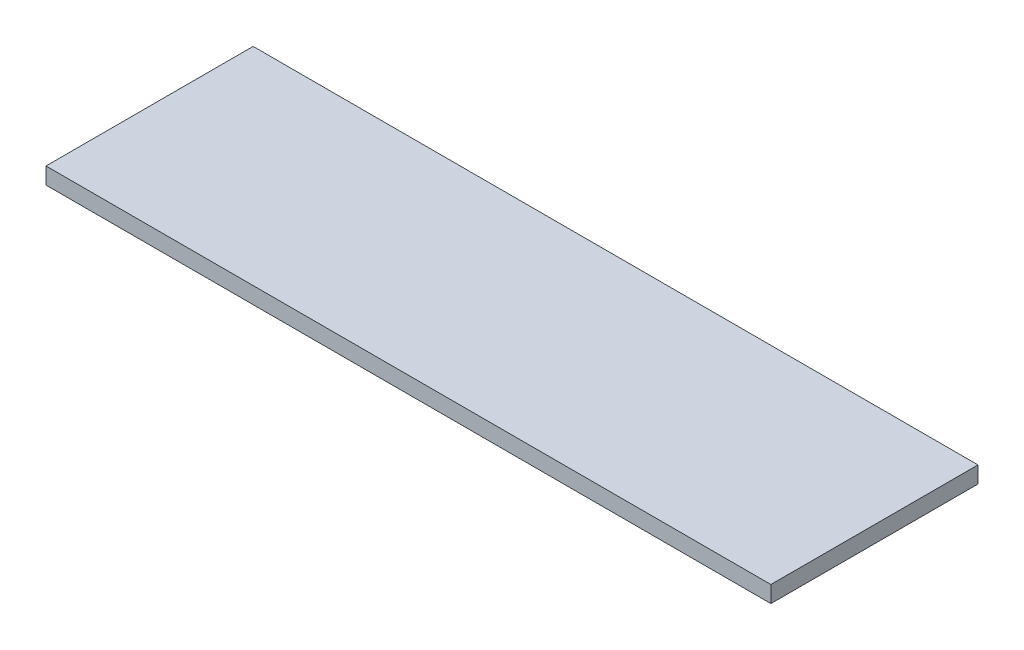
ISO-10303-21;
HEADER;
FILE_DESCRIPTION(('STEP AP214'),'2;1');
FILE_NAME('part.step','',(''),(''),'','','');
FILE_SCHEMA(('AUTOMOTIVE_DESIGN { 1 0 10303 214 1 1 1 1 }'));
ENDSEC;
DATA;
#1=APPLICATION_CONTEXT('core data for automotive mechanical design processes');
#2=APPLICATION_PROTOCOL_DEFINITION('international standard','automotive_design',2000,#1);
#3=PRODUCT_CONTEXT('',#1,'mechanical');
#4=PRODUCT('Part','Part','',(#3));
#5=PRODUCT_RELATED_PRODUCT_CATEGORY('part','',(#4));
#6=PRODUCT_DEFINITION_FORMATION('','',#4);
#7=PRODUCT_DEFINITION_CONTEXT('part definition',#1,'design');
#8=PRODUCT_DEFINITION('design','',#6,#7);
#9=PRODUCT_DEFINITION_SHAPE('','',#8);
#10=(LENGTH_UNIT() NAMED_UNIT(*) SI_UNIT(.MILLI.,.METRE.));
#11=(NAMED_UNIT(*) PLANE_ANGLE_UNIT() SI_UNIT($,.RADIAN.));
#12=(NAMED_UNIT(*) SI_UNIT($,.STERADIAN.) SOLID_ANGLE_UNIT());
#13=UNCERTAINTY_MEASURE_WITH_UNIT(LENGTH_MEASURE(1.E-05),#10,'distance_accuracy_value','');
#14=(GEOMETRIC_REPRESENTATION_CONTEXT(3) GLOBAL_UNCERTAINTY_ASSIGNED_CONTEXT((#13)) GLOBAL_UNIT_ASSIGNED_CONTEXT((#10,
#11,#12)) REPRESENTATION_CONTEXT('',''));
#15=CARTESIAN_POINT('',(0.,0.,0.));
#16=DIRECTION('',(0.,0.,1.));
#17=DIRECTION('',(1.,0.,0.));
#18=AXIS2_PLACEMENT_3D('',#15,#16,#17);
#19=CARTESIAN_POINT('',(44.45,2.032,-12.7));
#20=DIRECTION('',(-1.,0.,0.));
#21=DIRECTION('',(0.,0.,1.));
#22=AXIS2_PLACEMENT_3D('',#19,#20,#21);
#23=PLANE('',#22);
#24=DIRECTION('',(0.,0.,-1.));
#25=VECTOR('',#24,1.);
#26=CARTESIAN_POINT('',(44.45,0.,-12.7));
#27=LINE('',#26,#25);
#28=CARTESIAN_POINT('',(44.45,0.,12.7));
#29=VERTEX_POINT('',#28);
#30=CARTESIAN_POINT('',(44.45,0.,-12.7));
#31=VERTEX_POINT('',#30);
#32=EDGE_CURVE('E96',#29,#31,#27,.T.);
#33=ORIENTED_EDGE('',*,*,#32,.T.);
#34=DIRECTION('',(0.,-1.,0.));
#35=VECTOR('',#34,1.);
#36=CARTESIAN_POINT('',(44.45,2.032,-12.7));
#37=LINE('',#36,#35);
#38=CARTESIAN_POINT('',(44.45,2.032,-12.7));
#39=VERTEX_POINT('',#38);
#40=EDGE_CURVE('E11',#39,#31,#37,.T.);
#41=ORIENTED_EDGE('',*,*,#40,.F.);
#42=DIRECTION('',(0.,0.,-1.));
#43=VECTOR('',#42,1.);
#44=CARTESIAN_POINT('',(44.45,2.032,-12.7));
#45=LINE('',#44,#43);
#46=CARTESIAN_POINT('',(44.45,2.032,12.7));
#47=VERTEX_POINT('',#46);
#48=EDGE_CURVE('E84',#47,#39,#45,.T.);
#49=ORIENTED_EDGE('',*,*,#48,.F.);
#50=DIRECTION('',(0.,-1.,0.));
#51=VECTOR('',#50,1.);
#52=CARTESIAN_POINT('',(44.45,2.032,12.7));
#53=LINE('',#52,#51);
#54=EDGE_CURVE('E92',#47,#29,#53,.T.);
#55=ORIENTED_EDGE('',*,*,#54,.T.);
#56=EDGE_LOOP('',(#33,#41,#49,#55));
#57=FACE_BOUND('',#56,.T.);
#58=ADVANCED_FACE('F33',(#57),#23,.F.);
#59=CARTESIAN_POINT('',(-44.45,2.032,-12.7));
#60=DIRECTION('',(0.,0.,1.));
#61=DIRECTION('',(1.,0.,0.));
#62=AXIS2_PLACEMENT_3D('',#59,#60,#61);
#63=PLANE('',#62);
#64=DIRECTION('',(-1.,0.,0.));
#65=VECTOR('',#64,1.);
#66=CARTESIAN_POINT('',(-44.45,0.,-12.7));
#67=LINE('',#66,#65);
#68=CARTESIAN_POINT('',(-44.45,0.,-12.7));
#69=VERTEX_POINT('',#68);
#70=EDGE_CURVE('E88',#31,#69,#67,.T.);
#71=ORIENTED_EDGE('',*,*,#70,.T.);
#72=DIRECTION('',(0.,-1.,0.));
#73=VECTOR('',#72,1.);
#74=CARTESIAN_POINT('',(-44.45,2.032,-12.7));
#75=LINE('',#74,#73);
#76=CARTESIAN_POINT('',(-44.45,2.032,-12.7));
#77=VERTEX_POINT('',#76);
#78=EDGE_CURVE('E41',#77,#69,#75,.T.);
#79=ORIENTED_EDGE('',*,*,#78,.F.);
#80=DIRECTION('',(-1.,0.,0.));
#81=VECTOR('',#80,1.);
#82=CARTESIAN_POINT('',(-44.45,2.032,-12.7));
#83=LINE('',#82,#81);
#84=EDGE_CURVE('E79',#39,#77,#83,.T.);
#85=ORIENTED_EDGE('',*,*,#84,.F.);
#86=ORIENTED_EDGE('',*,*,#40,.T.);
#87=EDGE_LOOP('',(#71,#79,#85,#86));
#88=FACE_BOUND('',#87,.T.);
#89=ADVANCED_FACE('F87',(#88),#63,.F.);
#90=CARTESIAN_POINT('',(-44.45,2.032,-12.7));
#91=DIRECTION('',(1.,0.,0.));
#92=DIRECTION('',(0.,0.,-1.));
#93=AXIS2_PLACEMENT_3D('',#90,#91,#92);
#94=PLANE('',#93);
#95=DIRECTION('',(0.,0.,1.));
#96=VECTOR('',#95,1.);
#97=CARTESIAN_POINT('',(-44.45,0.,-12.7));
#98=LINE('',#97,#96);
#99=CARTESIAN_POINT('',(-44.45,0.,12.7));
#100=VERTEX_POINT('',#99);
#101=EDGE_CURVE('E66',#69,#100,#98,.T.);
#102=ORIENTED_EDGE('',*,*,#101,.T.);
#103=DIRECTION('',(0.,-1.,0.));
#104=VECTOR('',#103,1.);
#105=CARTESIAN_POINT('',(-44.45,2.032,12.7));
#106=LINE('',#105,#104);
#107=CARTESIAN_POINT('',(-44.45,2.032,12.7));
#108=VERTEX_POINT('',#107);
#109=EDGE_CURVE('E89',#108,#100,#106,.T.);
#110=ORIENTED_EDGE('',*,*,#109,.F.);
#111=DIRECTION('',(0.,0.,1.));
#112=VECTOR('',#111,1.);
#113=CARTESIAN_POINT('',(-44.45,2.032,-12.7));
#114=LINE('',#113,#112);
#115=EDGE_CURVE('E82',#77,#108,#114,.T.);
#116=ORIENTED_EDGE('',*,*,#115,.F.);
#117=ORIENTED_EDGE('',*,*,#78,.T.);
#118=EDGE_LOOP('',(#102,#110,#116,#117));
#119=FACE_BOUND('',#118,.T.);
#120=ADVANCED_FACE('F90',(#119),#94,.F.);
#121=CARTESIAN_POINT('',(-44.45,2.032,12.7));
#122=DIRECTION('',(0.,0.,-1.));
#123=DIRECTION('',(-1.,0.,0.));
#124=AXIS2_PLACEMENT_3D('',#121,#122,#123);
#125=PLANE('',#124);
#126=DIRECTION('',(1.,0.,0.));
#127=VECTOR('',#126,1.);
#128=CARTESIAN_POINT('',(-44.45,0.,12.7));
#129=LINE('',#128,#127);
#130=EDGE_CURVE('E72',#100,#29,#129,.T.);
#131=ORIENTED_EDGE('',*,*,#130,.T.);
#132=ORIENTED_EDGE('',*,*,#54,.F.);
#133=DIRECTION('',(1.,0.,0.));
#134=VECTOR('',#133,1.);
#135=CARTESIAN_POINT('',(-44.45,2.032,12.7));
#136=LINE('',#135,#134);
#137=EDGE_CURVE('E49',#108,#47,#136,.T.);
#138=ORIENTED_EDGE('',*,*,#137,.F.);
#139=ORIENTED_EDGE('',*,*,#109,.T.);
#140=EDGE_LOOP('',(#131,#132,#138,#139));
#141=FACE_BOUND('',#140,.T.);
#142=ADVANCED_FACE('F103',(#141),#125,.F.);
#143=CARTESIAN_POINT('',(0.,2.032,0.));
#144=DIRECTION('',(0.,1.,0.));
#145=DIRECTION('',(0.,0.,1.));
#146=AXIS2_PLACEMENT_3D('',#143,#144,#145);
#147=PLANE('',#146);
#148=ORIENTED_EDGE('',*,*,#48,.T.);
#149=ORIENTED_EDGE('',*,*,#84,.T.);
#150=ORIENTED_EDGE('',*,*,#115,.T.);
#151=ORIENTED_EDGE('',*,*,#137,.T.);
#152=EDGE_LOOP('',(#148,#149,#150,#151));
#153=FACE_BOUND('',#152,.T.);
#154=ADVANCED_FACE('F80',(#153),#147,.T.);
#155=CARTESIAN_POINT('',(0.,0.,0.));
#156=DIRECTION('',(0.,1.,0.));
#157=DIRECTION('',(0.,0.,1.));
#158=AXIS2_PLACEMENT_3D('',#155,#156,#157);
#159=PLANE('',#158);
#160=ORIENTED_EDGE('',*,*,#32,.F.);
#161=ORIENTED_EDGE('',*,*,#130,.F.);
#162=ORIENTED_EDGE('',*,*,#101,.F.);
#163=ORIENTED_EDGE('',*,*,#70,.F.);
#164=EDGE_LOOP('',(#160,#161,#162,#163));
#165=FACE_BOUND('',#164,.T.);
#166=ADVANCED_FACE('F106',(#165),#159,.F.);
#167=CLOSED_SHELL('',(#58,#89,#120,#142,#154,#166));
#168=MANIFOLD_SOLID_BREP('B2',#167);
#169=ADVANCED_BREP_SHAPE_REPRESENTATION('',(#18,#168),#14);
#170=SHAPE_DEFINITION_REPRESENTATION(#9,#169);
ENDSEC;
END-ISO-10303-21;
